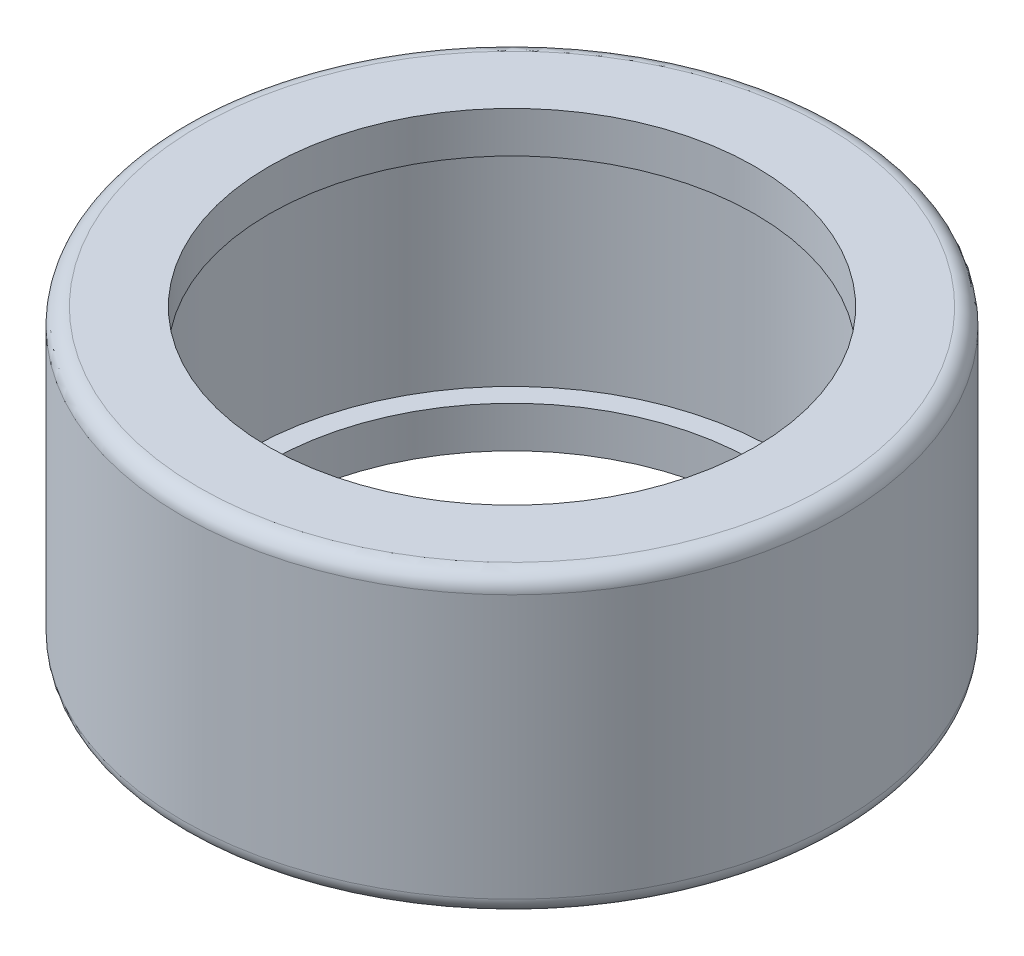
ISO-10303-21;
HEADER;
FILE_DESCRIPTION(('STEP AP214'),'2;1');
FILE_NAME('part.step','',(''),(''),'','','');
FILE_SCHEMA(('AUTOMOTIVE_DESIGN { 1 0 10303 214 1 1 1 1 }'));
ENDSEC;
DATA;
#1=APPLICATION_CONTEXT('core data for automotive mechanical design processes');
#2=APPLICATION_PROTOCOL_DEFINITION('international standard','automotive_design',2000,#1);
#3=PRODUCT_CONTEXT('',#1,'mechanical');
#4=PRODUCT('Part','Part','',(#3));
#5=PRODUCT_RELATED_PRODUCT_CATEGORY('part','',(#4));
#6=PRODUCT_DEFINITION_FORMATION('','',#4);
#7=PRODUCT_DEFINITION_CONTEXT('part definition',#1,'design');
#8=PRODUCT_DEFINITION('design','',#6,#7);
#9=PRODUCT_DEFINITION_SHAPE('','',#8);
#10=(LENGTH_UNIT() NAMED_UNIT(*) SI_UNIT(.MILLI.,.METRE.));
#11=(NAMED_UNIT(*) PLANE_ANGLE_UNIT() SI_UNIT($,.RADIAN.));
#12=(NAMED_UNIT(*) SI_UNIT($,.STERADIAN.) SOLID_ANGLE_UNIT());
#13=UNCERTAINTY_MEASURE_WITH_UNIT(LENGTH_MEASURE(1.E-05),#10,'distance_accuracy_value','');
#14=(GEOMETRIC_REPRESENTATION_CONTEXT(3) GLOBAL_UNCERTAINTY_ASSIGNED_CONTEXT((#13)) GLOBAL_UNIT_ASSIGNED_CONTEXT((#10,
#11,#12)) REPRESENTATION_CONTEXT('',''));
#15=CARTESIAN_POINT('',(0.,0.,0.));
#16=DIRECTION('',(0.,0.,1.));
#17=DIRECTION('',(1.,0.,0.));
#18=AXIS2_PLACEMENT_3D('',#15,#16,#17);
#19=CARTESIAN_POINT('',(0.,0.,0.));
#20=DIRECTION('',(0.,1.,0.));
#21=DIRECTION('',(0.,0.,1.));
#22=AXIS2_PLACEMENT_3D('',#19,#20,#21);
#23=CYLINDRICAL_SURFACE('',#22,7.375);
#24=CARTESIAN_POINT('',(0.,-3.25,0.));
#25=DIRECTION('',(0.,1.,0.));
#26=DIRECTION('',(0.,0.,1.));
#27=AXIS2_PLACEMENT_3D('',#24,#25,#26);
#28=CIRCLE('',#27,7.375);
#29=CARTESIAN_POINT('',(0.,-3.25,7.375));
#30=VERTEX_POINT('',#29);
#31=EDGE_CURVE('E388',#30,#30,#28,.T.);
#32=ORIENTED_EDGE('',*,*,#31,.T.);
#33=EDGE_LOOP('',(#32));
#34=FACE_BOUND('',#33,.T.);
#35=CARTESIAN_POINT('',(0.,-4.5,0.));
#36=DIRECTION('',(0.,1.,0.));
#37=DIRECTION('',(0.,0.,1.));
#38=AXIS2_PLACEMENT_3D('',#35,#36,#37);
#39=CIRCLE('',#38,7.375);
#40=CARTESIAN_POINT('',(0.,-4.5,7.375));
#41=VERTEX_POINT('',#40);
#42=EDGE_CURVE('E11',#41,#41,#39,.T.);
#43=ORIENTED_EDGE('',*,*,#42,.F.);
#44=EDGE_LOOP('',(#43));
#45=FACE_BOUND('',#44,.T.);
#46=ADVANCED_FACE('F352',(#34,#45),#23,.F.);
#47=CARTESIAN_POINT('',(-7.375,-4.5,0.));
#48=DIRECTION('',(0.,-1.,0.));
#49=DIRECTION('',(0.,0.,-1.));
#50=AXIS2_PLACEMENT_3D('',#47,#48,#49);
#51=PLANE('',#50);
#52=ORIENTED_EDGE('',*,*,#42,.T.);
#53=EDGE_LOOP('',(#52));
#54=FACE_BOUND('',#53,.T.);
#55=CARTESIAN_POINT('',(0.,-4.5,0.));
#56=DIRECTION('',(0.,1.,0.));
#57=DIRECTION('',(0.,0.,1.));
#58=AXIS2_PLACEMENT_3D('',#55,#56,#57);
#59=CIRCLE('',#58,9.5);
#60=CARTESIAN_POINT('',(0.,-4.5,9.5));
#61=VERTEX_POINT('',#60);
#62=EDGE_CURVE('E358',#61,#61,#59,.T.);
#63=ORIENTED_EDGE('',*,*,#62,.F.);
#64=EDGE_LOOP('',(#63));
#65=FACE_BOUND('',#64,.T.);
#66=ADVANCED_FACE('F406',(#54,#65),#51,.T.);
#67=CARTESIAN_POINT('',(0.,-4.,0.));
#68=DIRECTION('',(0.,1.,0.));
#69=DIRECTION('',(0.,0.,1.));
#70=AXIS2_PLACEMENT_3D('',#67,#68,#69);
#71=TOROIDAL_SURFACE('',#70,9.5,0.500000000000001);
#72=ORIENTED_EDGE('',*,*,#62,.T.);
#73=EDGE_LOOP('',(#72));
#74=FACE_BOUND('',#73,.T.);
#75=CARTESIAN_POINT('',(0.,-4.,0.));
#76=DIRECTION('',(0.,1.,0.));
#77=DIRECTION('',(0.,0.,1.));
#78=AXIS2_PLACEMENT_3D('',#75,#76,#77);
#79=CIRCLE('',#78,10.);
#80=CARTESIAN_POINT('',(0.,-4.,10.));
#81=VERTEX_POINT('',#80);
#82=EDGE_CURVE('E362',#81,#81,#79,.T.);
#83=ORIENTED_EDGE('',*,*,#82,.F.);
#84=EDGE_LOOP('',(#83));
#85=FACE_BOUND('',#84,.T.);
#86=ADVANCED_FACE('F411',(#74,#85),#71,.T.);
#87=CARTESIAN_POINT('',(0.,0.,0.));
#88=DIRECTION('',(0.,1.,0.));
#89=DIRECTION('',(0.,0.,1.));
#90=AXIS2_PLACEMENT_3D('',#87,#88,#89);
#91=CYLINDRICAL_SURFACE('',#90,10.);
#92=ORIENTED_EDGE('',*,*,#82,.T.);
#93=EDGE_LOOP('',(#92));
#94=FACE_BOUND('',#93,.T.);
#95=CARTESIAN_POINT('',(0.,4.,0.));
#96=DIRECTION('',(0.,1.,0.));
#97=DIRECTION('',(0.,0.,1.));
#98=AXIS2_PLACEMENT_3D('',#95,#96,#97);
#99=CIRCLE('',#98,10.);
#100=CARTESIAN_POINT('',(0.,4.,10.));
#101=VERTEX_POINT('',#100);
#102=EDGE_CURVE('E367',#101,#101,#99,.T.);
#103=ORIENTED_EDGE('',*,*,#102,.F.);
#104=EDGE_LOOP('',(#103));
#105=FACE_BOUND('',#104,.T.);
#106=ADVANCED_FACE('F416',(#94,#105),#91,.T.);
#107=CARTESIAN_POINT('',(0.,4.,0.));
#108=DIRECTION('',(0.,1.,0.));
#109=DIRECTION('',(0.,0.,1.));
#110=AXIS2_PLACEMENT_3D('',#107,#108,#109);
#111=TOROIDAL_SURFACE('',#110,9.5,0.500000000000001);
#112=ORIENTED_EDGE('',*,*,#102,.T.);
#113=EDGE_LOOP('',(#112));
#114=FACE_BOUND('',#113,.T.);
#115=CARTESIAN_POINT('',(0.,4.5,0.));
#116=DIRECTION('',(0.,1.,0.));
#117=DIRECTION('',(0.,0.,1.));
#118=AXIS2_PLACEMENT_3D('',#115,#116,#117);
#119=CIRCLE('',#118,9.5);
#120=CARTESIAN_POINT('',(0.,4.5,9.5));
#121=VERTEX_POINT('',#120);
#122=EDGE_CURVE('E373',#121,#121,#119,.T.);
#123=ORIENTED_EDGE('',*,*,#122,.F.);
#124=EDGE_LOOP('',(#123));
#125=FACE_BOUND('',#124,.T.);
#126=ADVANCED_FACE('F423',(#114,#125),#111,.T.);
#127=CARTESIAN_POINT('',(-7.375,4.5,0.));
#128=DIRECTION('',(0.,1.,0.));
#129=DIRECTION('',(0.,0.,1.));
#130=AXIS2_PLACEMENT_3D('',#127,#128,#129);
#131=PLANE('',#130);
#132=ORIENTED_EDGE('',*,*,#122,.T.);
#133=EDGE_LOOP('',(#132));
#134=FACE_BOUND('',#133,.T.);
#135=CARTESIAN_POINT('',(0.,4.5,0.));
#136=DIRECTION('',(0.,1.,0.));
#137=DIRECTION('',(0.,0.,1.));
#138=AXIS2_PLACEMENT_3D('',#135,#136,#137);
#139=CIRCLE('',#138,7.375);
#140=CARTESIAN_POINT('',(0.,4.5,7.375));
#141=VERTEX_POINT('',#140);
#142=EDGE_CURVE('E376',#141,#141,#139,.T.);
#143=ORIENTED_EDGE('',*,*,#142,.F.);
#144=EDGE_LOOP('',(#143));
#145=FACE_BOUND('',#144,.T.);
#146=ADVANCED_FACE('F427',(#134,#145),#131,.T.);
#147=CARTESIAN_POINT('',(0.,0.,0.));
#148=DIRECTION('',(0.,1.,0.));
#149=DIRECTION('',(0.,0.,1.));
#150=AXIS2_PLACEMENT_3D('',#147,#148,#149);
#151=CYLINDRICAL_SURFACE('',#150,7.375);
#152=ORIENTED_EDGE('',*,*,#142,.T.);
#153=EDGE_LOOP('',(#152));
#154=FACE_BOUND('',#153,.T.);
#155=CARTESIAN_POINT('',(0.,3.25,0.));
#156=DIRECTION('',(0.,1.,0.));
#157=DIRECTION('',(0.,0.,1.));
#158=AXIS2_PLACEMENT_3D('',#155,#156,#157);
#159=CIRCLE('',#158,7.375);
#160=CARTESIAN_POINT('',(0.,3.25,7.375));
#161=VERTEX_POINT('',#160);
#162=EDGE_CURVE('E379',#161,#161,#159,.T.);
#163=ORIENTED_EDGE('',*,*,#162,.F.);
#164=EDGE_LOOP('',(#163));
#165=FACE_BOUND('',#164,.T.);
#166=ADVANCED_FACE('F431',(#154,#165),#151,.F.);
#167=CARTESIAN_POINT('',(-7.375,3.25,0.));
#168=DIRECTION('',(0.,-1.,0.));
#169=DIRECTION('',(0.,0.,-1.));
#170=AXIS2_PLACEMENT_3D('',#167,#168,#169);
#171=PLANE('',#170);
#172=ORIENTED_EDGE('',*,*,#162,.T.);
#173=EDGE_LOOP('',(#172));
#174=FACE_BOUND('',#173,.T.);
#175=CARTESIAN_POINT('',(0.,3.25,0.));
#176=DIRECTION('',(0.,1.,0.));
#177=DIRECTION('',(0.,0.,1.));
#178=AXIS2_PLACEMENT_3D('',#175,#176,#177);
#179=CIRCLE('',#178,8.);
#180=CARTESIAN_POINT('',(0.,3.25,8.));
#181=VERTEX_POINT('',#180);
#182=EDGE_CURVE('E382',#181,#181,#179,.T.);
#183=ORIENTED_EDGE('',*,*,#182,.F.);
#184=EDGE_LOOP('',(#183));
#185=FACE_BOUND('',#184,.T.);
#186=ADVANCED_FACE('F402',(#174,#185),#171,.T.);
#187=CARTESIAN_POINT('',(0.,0.,0.));
#188=DIRECTION('',(0.,1.,0.));
#189=DIRECTION('',(0.,0.,1.));
#190=AXIS2_PLACEMENT_3D('',#187,#188,#189);
#191=CYLINDRICAL_SURFACE('',#190,8.);
#192=ORIENTED_EDGE('',*,*,#182,.T.);
#193=EDGE_LOOP('',(#192));
#194=FACE_BOUND('',#193,.T.);
#195=CARTESIAN_POINT('',(0.,-3.25,0.));
#196=DIRECTION('',(0.,1.,0.));
#197=DIRECTION('',(0.,0.,1.));
#198=AXIS2_PLACEMENT_3D('',#195,#196,#197);
#199=CIRCLE('',#198,8.);
#200=CARTESIAN_POINT('',(0.,-3.25,8.));
#201=VERTEX_POINT('',#200);
#202=EDGE_CURVE('E385',#201,#201,#199,.T.);
#203=ORIENTED_EDGE('',*,*,#202,.F.);
#204=EDGE_LOOP('',(#203));
#205=FACE_BOUND('',#204,.T.);
#206=ADVANCED_FACE('F396',(#194,#205),#191,.F.);
#207=CARTESIAN_POINT('',(-7.375,-3.25,0.));
#208=DIRECTION('',(0.,1.,0.));
#209=DIRECTION('',(0.,0.,1.));
#210=AXIS2_PLACEMENT_3D('',#207,#208,#209);
#211=PLANE('',#210);
#212=ORIENTED_EDGE('',*,*,#202,.T.);
#213=EDGE_LOOP('',(#212));
#214=FACE_BOUND('',#213,.T.);
#215=ORIENTED_EDGE('',*,*,#31,.F.);
#216=EDGE_LOOP('',(#215));
#217=FACE_BOUND('',#216,.T.);
#218=ADVANCED_FACE('F394',(#214,#217),#211,.T.);
#219=CLOSED_SHELL('',(#46,#66,#86,#106,#126,#146,#166,#186,#206,#218));
#220=MANIFOLD_SOLID_BREP('B2',#219);
#221=ADVANCED_BREP_SHAPE_REPRESENTATION('',(#18,#220),#14);
#222=SHAPE_DEFINITION_REPRESENTATION(#9,#221);
ENDSEC;
END-ISO-10303-21;
